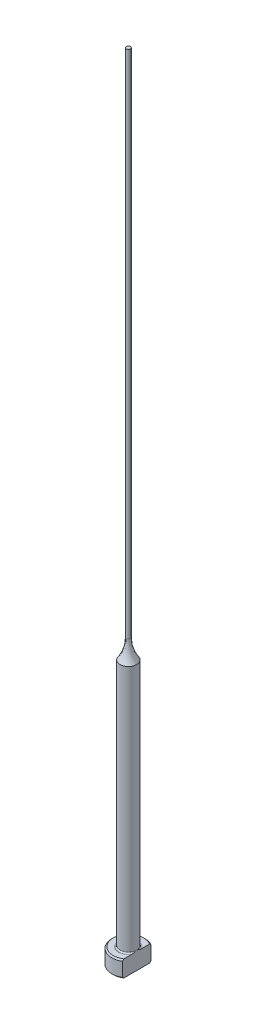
ISO-10303-21;
HEADER;
FILE_DESCRIPTION(('STEP AP214'),'2;1');
FILE_NAME('part.step','',(''),(''),'','','');
FILE_SCHEMA(('AUTOMOTIVE_DESIGN { 1 0 10303 214 1 1 1 1 }'));
ENDSEC;
DATA;
#1=APPLICATION_CONTEXT('core data for automotive mechanical design processes');
#2=APPLICATION_PROTOCOL_DEFINITION('international standard','automotive_design',2000,#1);
#3=PRODUCT_CONTEXT('',#1,'mechanical');
#4=PRODUCT('Part','Part','',(#3));
#5=PRODUCT_RELATED_PRODUCT_CATEGORY('part','',(#4));
#6=PRODUCT_DEFINITION_FORMATION('','',#4);
#7=PRODUCT_DEFINITION_CONTEXT('part definition',#1,'design');
#8=PRODUCT_DEFINITION('design','',#6,#7);
#9=PRODUCT_DEFINITION_SHAPE('','',#8);
#10=(LENGTH_UNIT() NAMED_UNIT(*) SI_UNIT(.MILLI.,.METRE.));
#11=(NAMED_UNIT(*) PLANE_ANGLE_UNIT() SI_UNIT($,.RADIAN.));
#12=(NAMED_UNIT(*) SI_UNIT($,.STERADIAN.) SOLID_ANGLE_UNIT());
#13=UNCERTAINTY_MEASURE_WITH_UNIT(LENGTH_MEASURE(1.E-05),#10,'distance_accuracy_value','');
#14=(GEOMETRIC_REPRESENTATION_CONTEXT(3) GLOBAL_UNCERTAINTY_ASSIGNED_CONTEXT((#13)) GLOBAL_UNIT_ASSIGNED_CONTEXT((#10,
#11,#12)) REPRESENTATION_CONTEXT('',''));
#15=CARTESIAN_POINT('',(0.,0.,0.));
#16=DIRECTION('',(0.,0.,1.));
#17=DIRECTION('',(1.,0.,0.));
#18=AXIS2_PLACEMENT_3D('',#15,#16,#17);
#19=CARTESIAN_POINT('',(-3.17499999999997,3.175,0.));
#20=DIRECTION('',(0.,1.,0.));
#21=DIRECTION('',(0.,0.,1.));
#22=AXIS2_PLACEMENT_3D('',#19,#20,#21);
#23=PLANE('',#22);
#24=CARTESIAN_POINT('',(0.,3.175,0.));
#25=DIRECTION('',(0.,1.,0.));
#26=DIRECTION('',(0.,0.,1.));
#27=AXIS2_PLACEMENT_3D('',#24,#25,#26);
#28=CIRCLE('',#27,2.92099999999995);
#29=CARTESIAN_POINT('',(1.58749999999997,3.175,-2.45195529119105));
#30=VERTEX_POINT('',#29);
#31=CARTESIAN_POINT('',(1.58749999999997,3.175,2.45195529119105));
#32=VERTEX_POINT('',#31);
#33=EDGE_CURVE('E105',#30,#32,#28,.T.);
#34=ORIENTED_EDGE('',*,*,#33,.T.);
#35=DIRECTION('',(0.,0.,1.));
#36=VECTOR('',#35,1.);
#37=CARTESIAN_POINT('',(1.58749999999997,3.17500000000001,2.74963065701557));
#38=LINE('',#37,#36);
#39=CARTESIAN_POINT('',(1.58749999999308,3.175,0.933255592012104));
#40=VERTEX_POINT('',#39);
#41=EDGE_CURVE('E126',#40,#32,#38,.T.);
#42=ORIENTED_EDGE('',*,*,#41,.F.);
#43=CARTESIAN_POINT('',(0.,3.175,0.));
#44=DIRECTION('',(0.,1.,0.));
#45=DIRECTION('',(0.,0.,1.));
#46=AXIS2_PLACEMENT_3D('',#43,#44,#45);
#47=CIRCLE('',#46,1.84149999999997);
#48=CARTESIAN_POINT('',(1.58749999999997,3.17500000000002,-0.933255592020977));
#49=VERTEX_POINT('',#48);
#50=EDGE_CURVE('E11',#40,#49,#47,.F.);
#51=ORIENTED_EDGE('',*,*,#50,.T.);
#52=EDGE_CURVE('E52',#30,#49,#38,.T.);
#53=ORIENTED_EDGE('',*,*,#52,.F.);
#54=EDGE_LOOP('',(#34,#42,#51,#53));
#55=FACE_BOUND('',#54,.T.);
#56=ADVANCED_FACE('F32',(#55),#23,.T.);
#57=CARTESIAN_POINT('',(0.,259.958771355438,0.));
#58=DIRECTION('',(0.,1.,0.));
#59=DIRECTION('',(0.,0.,1.));
#60=AXIS2_PLACEMENT_3D('',#57,#58,#59);
#61=CYLINDRICAL_SURFACE('',#60,3.17499999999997);
#62=CARTESIAN_POINT('',(0.,2.92100000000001,0.));
#63=DIRECTION('',(0.,1.,0.));
#64=DIRECTION('',(0.,0.,1.));
#65=AXIS2_PLACEMENT_3D('',#62,#63,#64);
#66=CIRCLE('',#65,3.17499999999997);
#67=CARTESIAN_POINT('',(1.58749999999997,2.92100000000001,2.74963065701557));
#68=VERTEX_POINT('',#67);
#69=CARTESIAN_POINT('',(1.58749999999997,2.92100000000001,-2.74963065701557));
#70=VERTEX_POINT('',#69);
#71=EDGE_CURVE('E98',#68,#70,#66,.F.);
#72=ORIENTED_EDGE('',*,*,#71,.T.);
#73=DIRECTION('',(0.,-1.,0.));
#74=VECTOR('',#73,1.);
#75=CARTESIAN_POINT('',(1.58749999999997,152.401,-2.74963065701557));
#76=LINE('',#75,#74);
#77=CARTESIAN_POINT('',(1.58749999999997,0.254000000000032,-2.74963065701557));
#78=VERTEX_POINT('',#77);
#79=EDGE_CURVE('E141',#70,#78,#76,.T.);
#80=ORIENTED_EDGE('',*,*,#79,.T.);
#81=CARTESIAN_POINT('',(0.,0.254000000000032,0.));
#82=DIRECTION('',(0.,-1.,0.));
#83=DIRECTION('',(0.,0.,-1.));
#84=AXIS2_PLACEMENT_3D('',#81,#82,#83);
#85=CIRCLE('',#84,3.17499999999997);
#86=CARTESIAN_POINT('',(1.58749999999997,0.254000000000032,2.74963065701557));
#87=VERTEX_POINT('',#86);
#88=EDGE_CURVE('E95',#78,#87,#85,.F.);
#89=ORIENTED_EDGE('',*,*,#88,.T.);
#90=DIRECTION('',(0.,-1.,0.));
#91=VECTOR('',#90,1.);
#92=CARTESIAN_POINT('',(1.58749999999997,152.401,2.74963065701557));
#93=LINE('',#92,#91);
#94=EDGE_CURVE('E88',#68,#87,#93,.T.);
#95=ORIENTED_EDGE('',*,*,#94,.F.);
#96=EDGE_LOOP('',(#72,#80,#89,#95));
#97=FACE_BOUND('',#96,.T.);
#98=ADVANCED_FACE('F191',(#97),#61,.T.);
#99=CARTESIAN_POINT('',(0.,0.,0.));
#100=DIRECTION('',(0.,-1.,0.));
#101=DIRECTION('',(0.,0.,-1.));
#102=AXIS2_PLACEMENT_3D('',#99,#100,#101);
#103=PLANE('',#102);
#104=CARTESIAN_POINT('',(0.,0.,0.));
#105=DIRECTION('',(0.,-1.,0.));
#106=DIRECTION('',(0.,0.,-1.));
#107=AXIS2_PLACEMENT_3D('',#104,#105,#106);
#108=CIRCLE('',#107,2.92099999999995);
#109=CARTESIAN_POINT('',(1.58749999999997,0.,2.45195529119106));
#110=VERTEX_POINT('',#109);
#111=CARTESIAN_POINT('',(1.58749999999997,0.,-2.45195529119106));
#112=VERTEX_POINT('',#111);
#113=EDGE_CURVE('E93',#110,#112,#108,.T.);
#114=ORIENTED_EDGE('',*,*,#113,.T.);
#115=DIRECTION('',(0.,0.,1.));
#116=VECTOR('',#115,1.);
#117=CARTESIAN_POINT('',(1.58749999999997,0.,2.74963065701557));
#118=LINE('',#117,#116);
#119=EDGE_CURVE('E78',#112,#110,#118,.T.);
#120=ORIENTED_EDGE('',*,*,#119,.T.);
#121=EDGE_LOOP('',(#114,#120));
#122=FACE_BOUND('',#121,.T.);
#123=ADVANCED_FACE('F97',(#122),#103,.T.);
#124=CARTESIAN_POINT('',(0.,3.17499999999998,0.));
#125=DIRECTION('',(0.,-1.,0.));
#126=DIRECTION('',(0.,0.,-1.));
#127=AXIS2_PLACEMENT_3D('',#124,#125,#126);
#128=CONICAL_SURFACE('',#127,2.92099999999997,0.7853981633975);
#129=ORIENTED_EDGE('',*,*,#71,.F.);
#130=CARTESIAN_POINT('',(1.58749999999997,-0.161620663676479,-6.0529050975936));
#131=CARTESIAN_POINT('',(1.58749999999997,-0.0288893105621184,-5.91567682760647));
#132=CARTESIAN_POINT('',(1.58749999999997,0.103699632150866,-5.77831035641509));
#133=CARTESIAN_POINT('',(1.58749999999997,0.36850839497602,-5.5032187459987));
#134=CARTESIAN_POINT('',(1.58749999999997,0.500728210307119,-5.36549360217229));
#135=CARTESIAN_POINT('',(1.58749999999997,0.764778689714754,-5.08953516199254));
#136=CARTESIAN_POINT('',(1.58749999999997,0.896609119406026,-4.95130164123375));
#137=CARTESIAN_POINT('',(1.58749999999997,1.15968706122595,-4.67428233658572));
#138=CARTESIAN_POINT('',(1.58749999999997,1.29093457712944,-4.53549655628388));
#139=CARTESIAN_POINT('',(1.58749999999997,1.55007705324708,-4.25997724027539));
#140=CARTESIAN_POINT('',(1.58749999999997,1.67798684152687,-4.12325766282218));
#141=CARTESIAN_POINT('',(1.58749999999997,1.93284861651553,-3.84892898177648));
#142=CARTESIAN_POINT('',(1.58749999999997,2.05980060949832,-3.71131988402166));
#143=CARTESIAN_POINT('',(1.58749999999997,2.31237508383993,-3.43493978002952));
#144=CARTESIAN_POINT('',(1.58749999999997,2.43799784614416,-3.29616903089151));
#145=CARTESIAN_POINT('',(1.58749999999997,2.68741369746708,-3.01699558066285));
#146=CARTESIAN_POINT('',(1.58749999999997,2.81120686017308,-2.87659294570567));
#147=CARTESIAN_POINT('',(1.58749999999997,3.0087586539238,-2.6481670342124));
#148=CARTESIAN_POINT('',(1.58749999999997,3.08336151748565,-2.56087478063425));
#149=CARTESIAN_POINT('',(1.58749999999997,3.23123871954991,-2.38515423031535));
#150=CARTESIAN_POINT('',(1.58749999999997,3.30451292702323,-2.29672582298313));
#151=CARTESIAN_POINT('',(1.58749999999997,3.45004422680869,-2.1174740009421));
#152=CARTESIAN_POINT('',(1.58749999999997,3.52228237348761,-2.02663514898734));
#153=CARTESIAN_POINT('',(1.58749999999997,3.6642309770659,-1.8430252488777));
#154=CARTESIAN_POINT('',(1.58749999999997,3.73394203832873,-1.75025467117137));
#155=CARTESIAN_POINT('',(1.58749999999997,3.87080633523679,-1.56067475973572));
#156=CARTESIAN_POINT('',(1.58749999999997,3.93790459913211,-1.46382547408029));
#157=CARTESIAN_POINT('',(1.58749999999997,4.06669147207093,-1.26632594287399));
#158=CARTESIAN_POINT('',(1.58749999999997,4.12837264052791,-1.16567073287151));
#159=CARTESIAN_POINT('',(1.58749999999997,4.2140225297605,-1.01165766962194));
#160=CARTESIAN_POINT('',(1.58749999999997,4.24127929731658,-0.960142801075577));
#161=CARTESIAN_POINT('',(1.58749999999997,4.29309798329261,-0.855780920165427));
#162=CARTESIAN_POINT('',(1.58749999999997,4.31765941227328,-0.802933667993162));
#163=CARTESIAN_POINT('',(1.58749999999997,4.38614656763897,-0.64246114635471));
#164=CARTESIAN_POINT('',(1.58749999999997,4.42510149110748,-0.532518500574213));
#165=CARTESIAN_POINT('',(1.58749999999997,4.46726244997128,-0.367680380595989));
#166=CARTESIAN_POINT('',(1.58749999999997,4.47844427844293,-0.314802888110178));
#167=CARTESIAN_POINT('',(1.58749999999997,4.495766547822,-0.2082097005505));
#168=CARTESIAN_POINT('',(1.58749999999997,4.50190743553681,-0.154494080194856));
#169=CARTESIAN_POINT('',(1.58749999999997,4.50871296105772,-0.0468792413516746));
#170=CARTESIAN_POINT('',(1.58749999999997,4.50939451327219,0.0070188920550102));
#171=CARTESIAN_POINT('',(1.58749999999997,4.50527679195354,0.114606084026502));
#172=CARTESIAN_POINT('',(1.58749999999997,4.50047706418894,0.168295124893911));
#173=CARTESIAN_POINT('',(1.58749999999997,4.48579689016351,0.274485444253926));
#174=CARTESIAN_POINT('',(1.58749999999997,4.47596081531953,0.326992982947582));
#175=CARTESIAN_POINT('',(1.58749999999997,4.45181809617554,0.430974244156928));
#176=CARTESIAN_POINT('',(1.58749999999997,4.43750969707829,0.48244755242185));
#177=CARTESIAN_POINT('',(1.58749999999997,4.40502489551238,0.584460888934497));
#178=CARTESIAN_POINT('',(1.58749999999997,4.38682724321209,0.634994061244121));
#179=CARTESIAN_POINT('',(1.58749999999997,4.34729308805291,0.734789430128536));
#180=CARTESIAN_POINT('',(1.58749999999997,4.32595722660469,0.784051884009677));
#181=CARTESIAN_POINT('',(1.58749999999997,4.25791922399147,0.930549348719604));
#182=CARTESIAN_POINT('',(1.58749999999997,4.20736047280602,1.02598802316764));
#183=CARTESIAN_POINT('',(1.58749999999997,4.09955451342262,1.2130431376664));
#184=CARTESIAN_POINT('',(1.58749999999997,4.04229912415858,1.30465471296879));
#185=CARTESIAN_POINT('',(1.58749999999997,3.9230874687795,1.4852621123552));
#186=CARTESIAN_POINT('',(1.58749999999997,3.86111349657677,1.57424615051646));
#187=CARTESIAN_POINT('',(1.58749999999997,3.73408621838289,1.74990003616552));
#188=CARTESIAN_POINT('',(1.58749999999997,3.66903444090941,1.8365709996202));
#189=CARTESIAN_POINT('',(1.58749999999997,3.53583371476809,2.00931764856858));
#190=CARTESIAN_POINT('',(1.58749999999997,3.46765527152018,2.09537048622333));
#191=CARTESIAN_POINT('',(1.58749999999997,3.32960643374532,2.26611736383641));
#192=CARTESIAN_POINT('',(1.58749999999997,3.25973586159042,2.35081125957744));
#193=CARTESIAN_POINT('',(1.58749999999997,3.04858139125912,2.60290121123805));
#194=CARTESIAN_POINT('',(1.58749999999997,2.90542388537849,2.76872537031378));
#195=CARTESIAN_POINT('',(1.58749999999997,2.64069522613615,3.06970913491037));
#196=CARTESIAN_POINT('',(1.58749999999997,2.5195945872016,3.20528660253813));
#197=CARTESIAN_POINT('',(1.58749999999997,2.275904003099,3.47510321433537));
#198=CARTESIAN_POINT('',(1.58749999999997,2.15331401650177,3.60934232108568));
#199=CARTESIAN_POINT('',(1.58749999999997,1.90694239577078,3.87695374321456));
#200=CARTESIAN_POINT('',(1.58749999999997,1.78315974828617,4.01032512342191));
#201=CARTESIAN_POINT('',(1.58749999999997,1.53478104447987,4.2763088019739));
#202=CARTESIAN_POINT('',(1.58749999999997,1.41018498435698,4.40892109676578));
#203=CARTESIAN_POINT('',(1.58749999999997,1.0457468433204,4.79499418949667));
#204=CARTESIAN_POINT('',(1.58749999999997,0.805076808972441,5.04767313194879));
#205=CARTESIAN_POINT('',(1.58749999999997,0.443121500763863,5.42550911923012));
#206=CARTESIAN_POINT('',(1.58749999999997,0.322378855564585,5.55118772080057));
#207=CARTESIAN_POINT('',(1.58749999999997,0.0805914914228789,5.80225207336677));
#208=CARTESIAN_POINT('',(1.58749999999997,-0.0404532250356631,5.92763782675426));
#209=CARTESIAN_POINT('',(1.58749999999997,-0.161620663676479,6.0529050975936));
#210=B_SPLINE_CURVE_WITH_KNOTS('',3,(#130,#131,#132,#133,#134,#135,#136,#137,#138,#139,#140,
#141,#142,#143,#144,#145,#146,#147,#148,#149,#150,#151,#152,#153,#154,#155,#156,#157,#158,#159,
#160,#161,#162,#163,#164,#165,#166,#167,#168,#169,#170,#171,#172,#173,#174,#175,#176,#177,#178,
#179,#180,#181,#182,#183,#184,#185,#186,#187,#188,#189,#190,#191,#192,#193,#194,#195,#196,#197,
#198,#199,#200,#201,#202,#203,#204,#205,#206,#207,#208,#209),.UNSPECIFIED.,.F.,.F.,(4,2,2,2,2,2,
2,2,2,2,2,2,2,2,2,2,2,2,2,2,2,2,2,2,2,2,2,2,2,2,2,2,2,2,2,2,2,2,2,4),(0.,0.572750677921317,
1.14550874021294,1.71856057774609,2.29160869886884,2.85328006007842,3.41494773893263,
3.97649423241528,4.53801804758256,4.88249307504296,5.22700189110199,5.57515326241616,
5.92322081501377,6.27657800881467,6.63041319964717,6.80518126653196,6.97998101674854,
7.32824262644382,7.49018491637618,7.65211285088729,7.813538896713,7.97497832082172,
8.13501929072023,8.29512313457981,8.4561251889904,8.61709438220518,8.94062993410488,
9.26456495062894,9.58978187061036,9.91483894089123,10.2441741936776,10.5735441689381,
11.2306812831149,11.7760337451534,12.3214014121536,12.8672825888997,13.4131663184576,
14.4600164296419,14.9828595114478,15.505698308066),.UNSPECIFIED.);
#211=EDGE_CURVE('E118',#32,#68,#210,.T.);
#212=ORIENTED_EDGE('',*,*,#211,.F.);
#213=ORIENTED_EDGE('',*,*,#33,.F.);
#214=EDGE_CURVE('E117',#70,#30,#210,.T.);
#215=ORIENTED_EDGE('',*,*,#214,.F.);
#216=EDGE_LOOP('',(#129,#212,#213,#215));
#217=FACE_BOUND('',#216,.T.);
#218=ADVANCED_FACE('F162',(#217),#128,.T.);
#219=CARTESIAN_POINT('',(0.,0.254000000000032,0.));
#220=DIRECTION('',(0.,1.,0.));
#221=DIRECTION('',(0.,0.,1.));
#222=AXIS2_PLACEMENT_3D('',#219,#220,#221);
#223=CONICAL_SURFACE('',#222,3.17499999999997,0.785398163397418);
#224=ORIENTED_EDGE('',*,*,#88,.F.);
#225=CARTESIAN_POINT('',(1.58749999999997,3.33662066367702,6.0529050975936));
#226=CARTESIAN_POINT('',(1.58749999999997,3.20388931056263,5.91567682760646));
#227=CARTESIAN_POINT('',(1.58749999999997,3.0713003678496,5.77831035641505));
#228=CARTESIAN_POINT('',(1.58749999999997,2.80649160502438,5.50321874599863));
#229=CARTESIAN_POINT('',(1.58749999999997,2.67427178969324,5.36549360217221));
#230=CARTESIAN_POINT('',(1.58749999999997,2.41022131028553,5.08953516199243));
#231=CARTESIAN_POINT('',(1.58749999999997,2.27839088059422,4.95130164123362));
#232=CARTESIAN_POINT('',(1.58749999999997,2.01531293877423,4.67428233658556));
#233=CARTESIAN_POINT('',(1.58749999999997,1.8840654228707,4.5354965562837));
#234=CARTESIAN_POINT('',(1.58749999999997,1.62492294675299,4.25997724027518));
#235=CARTESIAN_POINT('',(1.58749999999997,1.49701315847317,4.12325766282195));
#236=CARTESIAN_POINT('',(1.58749999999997,1.24215138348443,3.84892898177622));
#237=CARTESIAN_POINT('',(1.58749999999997,1.11519939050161,3.71131988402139));
#238=CARTESIAN_POINT('',(1.58749999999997,0.862624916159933,3.43493978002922));
#239=CARTESIAN_POINT('',(1.58749999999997,0.737002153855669,3.29616903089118));
#240=CARTESIAN_POINT('',(1.58749999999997,0.487586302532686,3.01699558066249));
#241=CARTESIAN_POINT('',(1.58749999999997,0.363793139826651,2.8765929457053));
#242=CARTESIAN_POINT('',(1.58749999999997,0.1662413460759,2.64816703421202));
#243=CARTESIAN_POINT('',(1.58749999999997,0.0916384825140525,2.56087478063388));
#244=CARTESIAN_POINT('',(1.58749999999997,-0.0562387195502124,2.385154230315));
#245=CARTESIAN_POINT('',(1.58749999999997,-0.129512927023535,2.29672582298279));
#246=CARTESIAN_POINT('',(1.58749999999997,-0.275044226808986,2.11747400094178));
#247=CARTESIAN_POINT('',(1.58749999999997,-0.34728237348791,2.02663514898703));
#248=CARTESIAN_POINT('',(1.58749999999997,-0.489230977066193,1.84302524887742));
#249=CARTESIAN_POINT('',(1.58749999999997,-0.558942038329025,1.75025467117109));
#250=CARTESIAN_POINT('',(1.58749999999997,-0.695806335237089,1.56067475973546));
#251=CARTESIAN_POINT('',(1.58749999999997,-0.762904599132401,1.46382547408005));
#252=CARTESIAN_POINT('',(1.58749999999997,-0.89169147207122,1.26632594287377));
#253=CARTESIAN_POINT('',(1.58749999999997,-0.953372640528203,1.16567073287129));
#254=CARTESIAN_POINT('',(1.58749999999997,-1.03902252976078,1.01165766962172));
#255=CARTESIAN_POINT('',(1.58749999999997,-1.06627929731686,0.960142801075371));
#256=CARTESIAN_POINT('',(1.58749999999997,-1.11809798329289,0.855780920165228));
#257=CARTESIAN_POINT('',(1.58749999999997,-1.14265941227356,0.802933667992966));
#258=CARTESIAN_POINT('',(1.58749999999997,-1.21114656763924,0.642461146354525));
#259=CARTESIAN_POINT('',(1.58749999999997,-1.25010149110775,0.532518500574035));
#260=CARTESIAN_POINT('',(1.58749999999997,-1.29226244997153,0.36768038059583));
#261=CARTESIAN_POINT('',(1.58749999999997,-1.30344427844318,0.31480288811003));
#262=CARTESIAN_POINT('',(1.58749999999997,-1.32076654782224,0.208209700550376));
#263=CARTESIAN_POINT('',(1.58749999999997,-1.32690743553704,0.154494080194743));
#264=CARTESIAN_POINT('',(1.58749999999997,-1.33371296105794,0.0468792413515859));
#265=CARTESIAN_POINT('',(1.58749999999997,-1.33439451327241,-0.0070188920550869));
#266=CARTESIAN_POINT('',(1.58749999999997,-1.33027679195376,-0.114606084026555));
#267=CARTESIAN_POINT('',(1.58749999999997,-1.32547706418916,-0.168295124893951));
#268=CARTESIAN_POINT('',(1.58749999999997,-1.31079689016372,-0.274485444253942));
#269=CARTESIAN_POINT('',(1.58749999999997,-1.30096081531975,-0.326992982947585));
#270=CARTESIAN_POINT('',(1.58749999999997,-1.27681809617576,-0.430974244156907));
#271=CARTESIAN_POINT('',(1.58749999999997,-1.26250969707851,-0.482447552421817));
#272=CARTESIAN_POINT('',(1.58749999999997,-1.2300248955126,-0.584460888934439));
#273=CARTESIAN_POINT('',(1.58749999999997,-1.21182724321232,-0.634994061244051));
#274=CARTESIAN_POINT('',(1.58749999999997,-1.17229308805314,-0.734789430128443));
#275=CARTESIAN_POINT('',(1.58749999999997,-1.15095722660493,-0.784051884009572));
#276=CARTESIAN_POINT('',(1.58749999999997,-1.08291922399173,-0.93054934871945));
#277=CARTESIAN_POINT('',(1.58749999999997,-1.0323604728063,-1.02598802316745));
#278=CARTESIAN_POINT('',(1.58749999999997,-0.92455451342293,-1.21304313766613));
#279=CARTESIAN_POINT('',(1.58749999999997,-0.867299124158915,-1.30465471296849));
#280=CARTESIAN_POINT('',(1.58749999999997,-0.748087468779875,-1.48526211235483));
#281=CARTESIAN_POINT('',(1.58749999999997,-0.686113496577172,-1.57424615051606));
#282=CARTESIAN_POINT('',(1.58749999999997,-0.559086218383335,-1.74990003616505));
#283=CARTESIAN_POINT('',(1.58749999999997,-0.494034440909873,-1.83657099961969));
#284=CARTESIAN_POINT('',(1.58749999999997,-0.360833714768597,-2.00931764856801));
#285=CARTESIAN_POINT('',(1.58749999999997,-0.292655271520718,-2.09537048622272));
#286=CARTESIAN_POINT('',(1.58749999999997,-0.154606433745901,-2.26611736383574));
#287=CARTESIAN_POINT('',(1.58749999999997,-0.084735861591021,-2.35081125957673));
#288=CARTESIAN_POINT('',(1.58749999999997,0.126418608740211,-2.60290121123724));
#289=CARTESIAN_POINT('',(1.58749999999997,0.26957611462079,-2.76872537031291));
#290=CARTESIAN_POINT('',(1.58749999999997,0.534304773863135,-3.06970913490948));
#291=CARTESIAN_POINT('',(1.58749999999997,0.655405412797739,-3.20528660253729));
#292=CARTESIAN_POINT('',(1.58749999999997,0.899095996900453,-3.47510321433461));
#293=CARTESIAN_POINT('',(1.58749999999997,1.02168598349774,-3.60934232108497));
#294=CARTESIAN_POINT('',(1.58749999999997,1.26805760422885,-3.87695374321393));
#295=CARTESIAN_POINT('',(1.58749999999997,1.39184025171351,-4.01032512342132));
#296=CARTESIAN_POINT('',(1.58749999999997,1.64021895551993,-4.2763088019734));
#297=CARTESIAN_POINT('',(1.58749999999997,1.76481501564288,-4.40892109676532));
#298=CARTESIAN_POINT('',(1.58749999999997,2.12925315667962,-4.79499418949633));
#299=CARTESIAN_POINT('',(1.58749999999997,2.36992319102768,-5.04767313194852));
#300=CARTESIAN_POINT('',(1.58749999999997,2.73187849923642,-5.42550911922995));
#301=CARTESIAN_POINT('',(1.58749999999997,2.85262114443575,-5.55118772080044));
#302=CARTESIAN_POINT('',(1.58749999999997,3.09440850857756,-5.8022520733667));
#303=CARTESIAN_POINT('',(1.58749999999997,3.21545322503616,-5.92763782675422));
#304=CARTESIAN_POINT('',(1.58749999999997,3.33662066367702,-6.0529050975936));
#305=B_SPLINE_CURVE_WITH_KNOTS('',3,(#225,#226,#227,#228,#229,#230,#231,#232,#233,#234,#235,
#236,#237,#238,#239,#240,#241,#242,#243,#244,#245,#246,#247,#248,#249,#250,#251,#252,#253,#254,
#255,#256,#257,#258,#259,#260,#261,#262,#263,#264,#265,#266,#267,#268,#269,#270,#271,#272,#273,
#274,#275,#276,#277,#278,#279,#280,#281,#282,#283,#284,#285,#286,#287,#288,#289,#290,#291,#292,
#293,#294,#295,#296,#297,#298,#299,#300,#301,#302,#303,#304),.UNSPECIFIED.,.F.,.F.,(4,2,2,2,2,2,
2,2,2,2,2,2,2,2,2,2,2,2,2,2,2,2,2,2,2,2,2,2,2,2,2,2,2,2,2,2,2,2,2,4),(0.,0.572750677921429,
1.14550874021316,1.71856057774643,2.29160869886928,2.85328006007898,3.41494773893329,
3.97649423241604,4.53801804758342,4.8824930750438,5.22700189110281,5.57515326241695,
5.92322081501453,6.27657800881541,6.63041319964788,6.80518126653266,6.97998101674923,
7.32824262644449,7.49018491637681,7.65211285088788,7.81353889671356,7.97497832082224,
8.13501929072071,8.29512313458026,8.45612518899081,8.61709438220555,8.94062993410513,
9.26456495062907,9.58978187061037,9.91483894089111,10.2441741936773,10.5735441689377,
11.2306812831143,11.776033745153,12.3214014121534,12.8672825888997,13.4131663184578,
14.4600164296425,14.9828595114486,15.505698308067),.UNSPECIFIED.);
#306=EDGE_CURVE('E81',#112,#78,#305,.T.);
#307=ORIENTED_EDGE('',*,*,#306,.F.);
#308=ORIENTED_EDGE('',*,*,#113,.F.);
#309=EDGE_CURVE('E84',#87,#110,#305,.T.);
#310=ORIENTED_EDGE('',*,*,#309,.F.);
#311=EDGE_LOOP('',(#224,#307,#308,#310));
#312=FACE_BOUND('',#311,.T.);
#313=ADVANCED_FACE('F92',(#312),#223,.T.);
#314=CARTESIAN_POINT('',(0.,3.42900000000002,0.));
#315=DIRECTION('',(0.,1.,0.));
#316=DIRECTION('',(0.,0.,1.));
#317=AXIS2_PLACEMENT_3D('',#314,#315,#316);
#318=TOROIDAL_SURFACE('',#317,1.84149999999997,0.254);
#319=CARTESIAN_POINT('',(1.58749999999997,3.42900000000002,0.));
#320=CARTESIAN_POINT('',(1.58749999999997,3.42899942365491,-1.9220514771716E-10));
#321=CARTESIAN_POINT('',(1.58749999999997,3.42899884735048,-1.2261161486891E-07));
#322=CARTESIAN_POINT('',(1.58749999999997,3.42899773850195,-5.09676365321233E-07));
#323=CARTESIAN_POINT('',(1.58749999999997,3.42899720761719,-7.78176328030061E-07));
#324=CARTESIAN_POINT('',(1.58749999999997,3.42899614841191,-1.42307272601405E-06));
#325=CARTESIAN_POINT('',(1.58749999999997,3.42899562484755,-1.80713867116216E-06));
#326=CARTESIAN_POINT('',(1.58749999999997,3.42899463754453,-2.63494846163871E-06));
#327=CARTESIAN_POINT('',(1.58749999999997,3.42899417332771,-3.07814756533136E-06));
#328=CARTESIAN_POINT('',(1.58749999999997,3.42899261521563,-4.66897357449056E-06));
#329=CARTESIAN_POINT('',(1.58749999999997,3.42899159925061,-5.89404908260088E-06));
#330=CARTESIAN_POINT('',(1.58749999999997,3.42898979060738,-8.42427511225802E-06));
#331=CARTESIAN_POINT('',(1.58749999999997,3.42898899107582,-9.7248057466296E-06));
#332=CARTESIAN_POINT('',(1.58749999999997,3.42898598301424,-1.48060601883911E-05));
#333=CARTESIAN_POINT('',(1.58749999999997,3.42898393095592,-1.86838281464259E-05));
#334=CARTESIAN_POINT('',(1.58749999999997,3.42898057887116,-2.63261117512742E-05));
#335=CARTESIAN_POINT('',(1.58749999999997,3.42897922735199,-3.00687417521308E-05));
#336=CARTESIAN_POINT('',(1.58749999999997,3.42897347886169,-4.60276298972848E-05));
#337=CARTESIAN_POINT('',(1.58749999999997,3.42896911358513,-5.8247019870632E-05));
#338=CARTESIAN_POINT('',(1.58749999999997,3.42896211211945,-8.11070097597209E-05));
#339=CARTESIAN_POINT('',(1.58749999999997,3.42895931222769,-9.16953114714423E-05));
#340=CARTESIAN_POINT('',(1.58749999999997,3.42893712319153,-0.000168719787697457));
#341=CARTESIAN_POINT('',(1.58749999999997,3.42890881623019,-0.000232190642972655));
#342=CARTESIAN_POINT('',(1.58749999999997,3.42880276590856,-0.000479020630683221));
#343=CARTESIAN_POINT('',(1.58749999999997,3.42873165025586,-0.00066443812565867));
#344=CARTESIAN_POINT('',(1.58749999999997,3.42845137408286,-0.0013844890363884));
#345=CARTESIAN_POINT('',(1.58749999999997,3.42823526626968,-0.00191701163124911));
#346=CARTESIAN_POINT('',(1.58749999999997,3.42735449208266,-0.00409774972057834));
#347=CARTESIAN_POINT('',(1.58749999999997,3.42669768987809,-0.00574830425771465));
#348=CARTESIAN_POINT('',(1.58749999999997,3.4174405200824,-0.0289985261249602));
#349=CARTESIAN_POINT('',(1.58749999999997,3.40878325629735,-0.0505816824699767));
#350=CARTESIAN_POINT('',(1.58749999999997,3.39189297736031,-0.0929947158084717));
#351=CARTESIAN_POINT('',(1.58749999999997,3.38365605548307,-0.11382315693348));
#352=CARTESIAN_POINT('',(1.58749999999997,3.36635393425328,-0.157956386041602));
#353=CARTESIAN_POINT('',(1.58749999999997,3.35730391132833,-0.181267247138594));
#354=CARTESIAN_POINT('',(1.58749999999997,3.33936775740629,-0.228222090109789));
#355=CARTESIAN_POINT('',(1.58749999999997,3.33048420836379,-0.25186705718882));
#356=CARTESIAN_POINT('',(1.58749999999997,3.30894496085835,-0.310512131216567));
#357=CARTESIAN_POINT('',(1.58749999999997,3.29649449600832,-0.345588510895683));
#358=CARTESIAN_POINT('',(1.58749999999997,3.27296975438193,-0.415278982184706));
#359=CARTESIAN_POINT('',(1.58749999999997,3.26186987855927,-0.449884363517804));
#360=CARTESIAN_POINT('',(1.58749999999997,3.2395832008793,-0.524471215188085));
#361=CARTESIAN_POINT('',(1.58749999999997,3.22860862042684,-0.564517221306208));
#362=CARTESIAN_POINT('',(1.58749999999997,3.20902534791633,-0.645529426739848));
#363=CARTESIAN_POINT('',(1.58749999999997,3.20043582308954,-0.686500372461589));
#364=CARTESIAN_POINT('',(1.58749999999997,3.18611712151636,-0.771546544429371));
#365=CARTESIAN_POINT('',(1.58749999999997,3.18059550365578,-0.815658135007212));
#366=CARTESIAN_POINT('',(1.58749999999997,3.17455396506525,-0.904117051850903));
#367=CARTESIAN_POINT('',(1.58749999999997,3.17401361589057,-0.948462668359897));
#368=CARTESIAN_POINT('',(1.58749999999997,3.17898948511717,-1.02531896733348));
#369=CARTESIAN_POINT('',(1.58749999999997,3.1829739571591,-1.05792141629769));
#370=CARTESIAN_POINT('',(1.58749999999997,3.19569167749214,-1.12184393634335));
#371=CARTESIAN_POINT('',(1.58749999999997,3.20436049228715,-1.1531753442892));
#372=CARTESIAN_POINT('',(1.58749999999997,3.22236152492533,-1.19946468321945));
#373=CARTESIAN_POINT('',(1.58749999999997,3.2295150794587,-1.21526783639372));
#374=CARTESIAN_POINT('',(1.58749999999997,3.24587062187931,-1.24583726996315));
#375=CARTESIAN_POINT('',(1.58749999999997,3.25507530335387,-1.26060215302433));
#376=CARTESIAN_POINT('',(1.58749999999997,3.27378481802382,-1.28575815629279));
#377=CARTESIAN_POINT('',(1.58749999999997,3.28289001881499,-1.29644383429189));
#378=CARTESIAN_POINT('',(1.58749999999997,3.30268460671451,-1.31623154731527));
#379=CARTESIAN_POINT('',(1.58749999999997,3.31337067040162,-1.32533681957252));
#380=CARTESIAN_POINT('',(1.58749999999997,3.33349977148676,-1.33941140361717));
#381=CARTESIAN_POINT('',(1.58749999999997,3.34261446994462,-1.34484814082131));
#382=CARTESIAN_POINT('',(1.58749999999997,3.36161455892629,-1.35416329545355));
#383=CARTESIAN_POINT('',(1.58749999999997,3.37149946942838,-1.35804267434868));
#384=CARTESIAN_POINT('',(1.58749999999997,3.39188678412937,-1.36398436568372));
#385=CARTESIAN_POINT('',(1.58749999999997,3.40239309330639,-1.36603350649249));
#386=CARTESIAN_POINT('',(1.58749999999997,3.42360372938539,-1.3680840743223));
#387=CARTESIAN_POINT('',(1.58749999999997,3.43430795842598,-1.36808648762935));
#388=CARTESIAN_POINT('',(1.58749999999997,3.45433283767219,-1.36616208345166));
#389=CARTESIAN_POINT('',(1.58749999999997,3.46367506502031,-1.36444960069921));
#390=CARTESIAN_POINT('',(1.58749999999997,3.48195519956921,-1.35953338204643));
#391=CARTESIAN_POINT('',(1.58749999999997,3.49089304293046,-1.3563294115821));
#392=CARTESIAN_POINT('',(1.58749999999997,3.50850302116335,-1.34848006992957));
#393=CARTESIAN_POINT('',(1.58749999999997,3.5171531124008,-1.34378578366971));
#394=CARTESIAN_POINT('',(1.58749999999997,3.53371257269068,-1.33324445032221));
#395=CARTESIAN_POINT('',(1.58749999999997,3.54162163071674,-1.32739692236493));
#396=CARTESIAN_POINT('',(1.58749999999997,3.56107121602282,-1.31107304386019));
#397=CARTESIAN_POINT('',(1.58749999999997,3.57202221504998,-1.29989286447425));
#398=CARTESIAN_POINT('',(1.58749999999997,3.59202509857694,-1.27593566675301));
#399=CARTESIAN_POINT('',(1.58749999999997,3.60107086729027,-1.26315370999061));
#400=CARTESIAN_POINT('',(1.58749999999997,3.62186023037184,-1.22930733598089));
#401=CARTESIAN_POINT('',(1.58749999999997,3.63240584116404,-1.20751096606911));
#402=CARTESIAN_POINT('',(1.58749999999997,3.65004643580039,-1.16266144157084));
#403=CARTESIAN_POINT('',(1.58749999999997,3.65714435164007,-1.13960937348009));
#404=CARTESIAN_POINT('',(1.58749999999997,3.67265428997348,-1.07603916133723));
#405=CARTESIAN_POINT('',(1.58749999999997,3.67834921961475,-1.03486686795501));
#406=CARTESIAN_POINT('',(1.58749999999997,3.68382880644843,-0.951558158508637));
#407=CARTESIAN_POINT('',(1.58749999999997,3.68350976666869,-0.909417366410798));
#408=CARTESIAN_POINT('',(1.58749999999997,3.67745397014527,-0.811383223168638));
#409=CARTESIAN_POINT('',(1.58749999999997,3.66993873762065,-0.755610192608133));
#410=CARTESIAN_POINT('',(1.58749999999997,3.64933373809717,-0.644937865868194));
#411=CARTESIAN_POINT('',(1.58749999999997,3.63621897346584,-0.59004364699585));
#412=CARTESIAN_POINT('',(1.58749999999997,3.60740922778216,-0.485757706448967));
#413=CARTESIAN_POINT('',(1.58749999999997,3.59201096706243,-0.436281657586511));
#414=CARTESIAN_POINT('',(1.58749999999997,3.55922497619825,-0.338551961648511));
#415=CARTESIAN_POINT('',(1.58749999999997,3.5418584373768,-0.290291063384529));
#416=CARTESIAN_POINT('',(1.58749999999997,3.51760237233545,-0.225557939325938));
#417=CARTESIAN_POINT('',(1.58749999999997,3.51126413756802,-0.208874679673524));
#418=CARTESIAN_POINT('',(1.58749999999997,3.49830042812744,-0.17512392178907));
#419=CARTESIAN_POINT('',(1.58749999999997,3.49167176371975,-0.158057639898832));
#420=CARTESIAN_POINT('',(1.58749999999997,3.47585523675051,-0.117638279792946));
#421=CARTESIAN_POINT('',(1.58749999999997,3.46662970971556,-0.0943002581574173));
#422=CARTESIAN_POINT('',(1.58749999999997,3.44889695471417,-0.0497824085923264));
#423=CARTESIAN_POINT('',(1.58749999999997,3.44040039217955,-0.028598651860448));
#424=CARTESIAN_POINT('',(1.58749999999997,3.43130364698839,-0.00575168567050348));
#425=CARTESIAN_POINT('',(1.58749999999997,3.43064818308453,-0.00410451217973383));
#426=CARTESIAN_POINT('',(1.58749999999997,3.42976776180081,-0.00192459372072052));
#427=CARTESIAN_POINT('',(1.58749999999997,3.42955062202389,-0.00138952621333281));
#428=CARTESIAN_POINT('',(1.58749999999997,3.42926908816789,-0.000666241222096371));
#429=CARTESIAN_POINT('',(1.58749999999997,3.42919771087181,-0.000480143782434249));
#430=CARTESIAN_POINT('',(1.58749999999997,3.42909131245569,-0.000232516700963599));
#431=CARTESIAN_POINT('',(1.58749999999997,3.42906294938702,-0.000168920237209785));
#432=CARTESIAN_POINT('',(1.58749999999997,3.42904072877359,-9.17527162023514E-05));
#433=CARTESIAN_POINT('',(1.58749999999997,3.42903792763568,-8.11550293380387E-05));
#434=CARTESIAN_POINT('',(1.58749999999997,3.42903091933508,-5.82743948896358E-05));
#435=CARTESIAN_POINT('',(1.58749999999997,3.42902654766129,-4.60440001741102E-05));
#436=CARTESIAN_POINT('',(1.58749999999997,3.42902079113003,-3.00727682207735E-05));
#437=CARTESIAN_POINT('',(1.58749999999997,3.42901943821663,-2.63286807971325E-05));
#438=CARTESIAN_POINT('',(1.58749999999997,3.42901608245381,-1.86836529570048E-05));
#439=CARTESIAN_POINT('',(1.58749999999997,3.4290140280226,-1.48046517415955E-05));
#440=CARTESIAN_POINT('',(1.58749999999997,3.42901101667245,-9.72223943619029E-06));
#441=CARTESIAN_POINT('',(1.58749999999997,3.42901021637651,-8.42159649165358E-06));
#442=CARTESIAN_POINT('',(1.58749999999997,3.42900840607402,-5.89129729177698E-06));
#443=CARTESIAN_POINT('',(1.58749999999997,3.42900738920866,-4.66626867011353E-06));
#444=CARTESIAN_POINT('',(1.58749999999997,3.42900582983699,-3.07568803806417E-06));
#445=CARTESIAN_POINT('',(1.58749999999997,3.42900536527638,-2.63259565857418E-06));
#446=CARTESIAN_POINT('',(1.58749999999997,3.4290043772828,-1.80506085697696E-06));
#447=CARTESIAN_POINT('',(1.58749999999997,3.42900385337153,-1.42116387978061E-06));
#448=CARTESIAN_POINT('',(1.58749999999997,3.42900279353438,-7.76675643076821E-07));
#449=CARTESIAN_POINT('',(1.58749999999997,3.42900226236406,-5.08406487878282E-07));
#450=CARTESIAN_POINT('',(1.58749999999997,3.42900115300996,-1.21901887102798E-07));
#451=CARTESIAN_POINT('',(1.58749999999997,3.42900057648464,1.92251677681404E-10));
#452=CARTESIAN_POINT('',(1.58749999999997,3.42900000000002,0.));
#453=B_SPLINE_CURVE_WITH_KNOTS('',3,(#319,#320,#321,#322,#323,#324,#325,#326,#327,#328,#329,
#330,#331,#332,#333,#334,#335,#336,#337,#338,#339,#340,#341,#342,#343,#344,#345,#346,#347,#348,
#349,#350,#351,#352,#353,#354,#355,#356,#357,#358,#359,#360,#361,#362,#363,#364,#365,#366,#367,
#368,#369,#370,#371,#372,#373,#374,#375,#376,#377,#378,#379,#380,#381,#382,#383,#384,#385,#386,
#387,#388,#389,#390,#391,#392,#393,#394,#395,#396,#397,#398,#399,#400,#401,#402,#403,#404,#405,
#406,#407,#408,#409,#410,#411,#412,#413,#414,#415,#416,#417,#418,#419,#420,#421,#422,#423,#424,
#425,#426,#427,#428,#429,#430,#431,#432,#433,#434,#435,#436,#437,#438,#439,#440,#441,#442,#443,
#444,#445,#446,#447,#448,#449,#450,#451,#452),.UNSPECIFIED.,.T.,.F.,(4,2,2,2,2,2,2,2,2,2,2,2,2,
2,2,2,2,2,2,2,2,2,2,2,2,2,2,2,2,2,2,2,2,2,2,2,2,2,2,2,2,2,2,2,2,2,2,2,2,2,2,2,2,2,2,2,2,2,2,2,2,
2,2,2,2,2,4),(0.,1.72815458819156E-06,3.50429255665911E-06,5.44431004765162E-06,
7.3675525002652E-06,1.2119089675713E-05,1.66953775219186E-05,2.98160400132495E-05,
4.17409564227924E-05,8.0660475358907E-05,0.000113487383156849,0.000321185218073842,
0.000917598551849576,0.00264089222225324,0.00797105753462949,0.0777276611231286,
0.144923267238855,0.219939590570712,0.295714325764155,0.407362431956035,0.516367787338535,
0.640878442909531,0.766362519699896,0.899536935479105,1.03216495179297,1.13045740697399,
1.22743103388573,1.27935899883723,1.33135556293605,1.37333248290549,1.41522237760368,
1.44693946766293,1.47863694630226,1.51056074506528,1.54246916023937,1.57083210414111,
1.59919951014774,1.62861579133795,1.65804436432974,1.70472658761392,1.75155645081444,
1.82378709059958,1.89595619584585,2.01995471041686,2.1460932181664,2.31447224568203,
2.48361094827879,2.6389891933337,2.79283011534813,2.84637031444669,2.9012946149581,
2.97658236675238,3.04504771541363,3.05036697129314,3.05209849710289,3.05269709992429,
3.05290520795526,3.05293806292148,3.05297701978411,3.05298895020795,3.05300207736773,
3.05300665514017,3.0530114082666,3.05301333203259,3.05301527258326,3.05301704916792,
3.05301877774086),.UNSPECIFIED.);
#454=CARTESIAN_POINT('',(1.58749999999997,3.42900000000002,0.));
#455=VERTEX_POINT('',#454);
#456=EDGE_CURVE('E47',#455,#49,#453,.T.);
#457=ORIENTED_EDGE('',*,*,#456,.T.);
#458=ORIENTED_EDGE('',*,*,#50,.F.);
#459=CARTESIAN_POINT('',(1.58749999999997,3.42900000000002,0.));
#460=CARTESIAN_POINT('',(1.58749999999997,3.42900057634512,1.9220512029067E-10));
#461=CARTESIAN_POINT('',(1.58749999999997,3.42900115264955,1.22611614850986E-07));
#462=CARTESIAN_POINT('',(1.58749999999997,3.42900226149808,5.09676365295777E-07));
#463=CARTESIAN_POINT('',(1.58749999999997,3.42900279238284,7.78176328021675E-07));
#464=CARTESIAN_POINT('',(1.58749999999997,3.42900385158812,1.42307272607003E-06));
#465=CARTESIAN_POINT('',(1.58749999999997,3.42900437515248,1.80713867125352E-06));
#466=CARTESIAN_POINT('',(1.58749999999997,3.4290053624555,2.63494846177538E-06));
#467=CARTESIAN_POINT('',(1.58749999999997,3.42900582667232,3.0781475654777E-06));
#468=CARTESIAN_POINT('',(1.58749999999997,3.4290073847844,4.66897357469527E-06));
#469=CARTESIAN_POINT('',(1.58749999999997,3.42900840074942,5.89404908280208E-06));
#470=CARTESIAN_POINT('',(1.58749999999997,3.42901020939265,8.42427511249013E-06));
#471=CARTESIAN_POINT('',(1.58749999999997,3.42901100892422,9.72480574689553E-06));
#472=CARTESIAN_POINT('',(1.58749999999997,3.42901401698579,1.48060601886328E-05));
#473=CARTESIAN_POINT('',(1.58749999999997,3.42901606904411,1.86838281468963E-05));
#474=CARTESIAN_POINT('',(1.58749999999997,3.42901942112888,2.63261117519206E-05));
#475=CARTESIAN_POINT('',(1.58749999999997,3.42902077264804,3.00687417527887E-05));
#476=CARTESIAN_POINT('',(1.58749999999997,3.42902652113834,4.60276298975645E-05));
#477=CARTESIAN_POINT('',(1.58749999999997,3.4290308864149,5.82470198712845E-05));
#478=CARTESIAN_POINT('',(1.58749999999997,3.42903788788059,8.11070097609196E-05));
#479=CARTESIAN_POINT('',(1.58749999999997,3.42904068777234,9.16953114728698E-05));
#480=CARTESIAN_POINT('',(1.58749999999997,3.4290628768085,0.000168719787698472));
#481=CARTESIAN_POINT('',(1.58749999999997,3.42909118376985,0.000232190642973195));
#482=CARTESIAN_POINT('',(1.58749999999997,3.42919723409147,0.000479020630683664));
#483=CARTESIAN_POINT('',(1.58749999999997,3.42926834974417,0.000664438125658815));
#484=CARTESIAN_POINT('',(1.58749999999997,3.42954862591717,0.00138448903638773));
#485=CARTESIAN_POINT('',(1.58749999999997,3.42976473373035,0.00191701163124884));
#486=CARTESIAN_POINT('',(1.58749999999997,3.43064550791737,0.00409774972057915));
#487=CARTESIAN_POINT('',(1.58749999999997,3.43130231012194,0.00574830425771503));
#488=CARTESIAN_POINT('',(1.58749999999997,3.44055947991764,0.0289985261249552));
#489=CARTESIAN_POINT('',(1.58749999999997,3.44921674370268,0.0505816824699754));
#490=CARTESIAN_POINT('',(1.58749999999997,3.46610702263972,0.0929947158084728));
#491=CARTESIAN_POINT('',(1.58749999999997,3.47434394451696,0.11382315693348));
#492=CARTESIAN_POINT('',(1.58749999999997,3.49164606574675,0.157956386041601));
#493=CARTESIAN_POINT('',(1.58749999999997,3.5006960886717,0.181267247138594));
#494=CARTESIAN_POINT('',(1.58749999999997,3.51863224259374,0.228222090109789));
#495=CARTESIAN_POINT('',(1.58749999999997,3.52751579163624,0.25186705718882));
#496=CARTESIAN_POINT('',(1.58749999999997,3.54905503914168,0.310512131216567));
#497=CARTESIAN_POINT('',(1.58749999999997,3.56150550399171,0.345588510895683));
#498=CARTESIAN_POINT('',(1.58749999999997,3.5850302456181,0.415278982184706));
#499=CARTESIAN_POINT('',(1.58749999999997,3.59613012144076,0.449884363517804));
#500=CARTESIAN_POINT('',(1.58749999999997,3.61841679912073,0.524471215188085));
#501=CARTESIAN_POINT('',(1.58749999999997,3.62939137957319,0.564517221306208));
#502=CARTESIAN_POINT('',(1.58749999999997,3.6489746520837,0.645529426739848));
#503=CARTESIAN_POINT('',(1.58749999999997,3.65756417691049,0.686500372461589));
#504=CARTESIAN_POINT('',(1.58749999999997,3.67188287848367,0.771546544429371));
#505=CARTESIAN_POINT('',(1.58749999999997,3.67740449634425,0.815658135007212));
#506=CARTESIAN_POINT('',(1.58749999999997,3.68344603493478,0.904117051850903));
#507=CARTESIAN_POINT('',(1.58749999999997,3.68398638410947,0.948462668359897));
#508=CARTESIAN_POINT('',(1.58749999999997,3.67901051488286,1.02531896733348));
#509=CARTESIAN_POINT('',(1.58749999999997,3.67502604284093,1.05792141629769));
#510=CARTESIAN_POINT('',(1.58749999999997,3.66230832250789,1.12184393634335));
#511=CARTESIAN_POINT('',(1.58749999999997,3.65363950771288,1.1531753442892));
#512=CARTESIAN_POINT('',(1.58749999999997,3.6356384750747,1.19946468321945));
#513=CARTESIAN_POINT('',(1.58749999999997,3.62848492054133,1.21526783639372));
#514=CARTESIAN_POINT('',(1.58749999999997,3.61212937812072,1.24583726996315));
#515=CARTESIAN_POINT('',(1.58749999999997,3.60292469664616,1.26060215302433));
#516=CARTESIAN_POINT('',(1.58749999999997,3.58421518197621,1.28575815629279));
#517=CARTESIAN_POINT('',(1.58749999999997,3.57510998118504,1.29644383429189));
#518=CARTESIAN_POINT('',(1.58749999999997,3.55531539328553,1.31623154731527));
#519=CARTESIAN_POINT('',(1.58749999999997,3.54462932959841,1.32533681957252));
#520=CARTESIAN_POINT('',(1.58749999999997,3.52450022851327,1.33941140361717));
#521=CARTESIAN_POINT('',(1.58749999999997,3.51538553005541,1.34484814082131));
#522=CARTESIAN_POINT('',(1.58749999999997,3.49638544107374,1.35416329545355));
#523=CARTESIAN_POINT('',(1.58749999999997,3.48650053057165,1.35804267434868));
#524=CARTESIAN_POINT('',(1.58749999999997,3.46611321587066,1.36398436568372));
#525=CARTESIAN_POINT('',(1.58749999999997,3.45560690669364,1.36603350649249));
#526=CARTESIAN_POINT('',(1.58749999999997,3.43439627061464,1.3680840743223));
#527=CARTESIAN_POINT('',(1.58749999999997,3.42369204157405,1.36808648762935));
#528=CARTESIAN_POINT('',(1.58749999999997,3.40366716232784,1.36616208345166));
#529=CARTESIAN_POINT('',(1.58749999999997,3.39432493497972,1.36444960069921));
#530=CARTESIAN_POINT('',(1.58749999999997,3.37604480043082,1.35953338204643));
#531=CARTESIAN_POINT('',(1.58749999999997,3.36710695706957,1.3563294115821));
#532=CARTESIAN_POINT('',(1.58749999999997,3.34949697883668,1.34848006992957));
#533=CARTESIAN_POINT('',(1.58749999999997,3.34084688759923,1.34378578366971));
#534=CARTESIAN_POINT('',(1.58749999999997,3.32428742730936,1.33324445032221));
#535=CARTESIAN_POINT('',(1.58749999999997,3.31637836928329,1.32739692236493));
#536=CARTESIAN_POINT('',(1.58749999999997,3.29692878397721,1.31107304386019));
#537=CARTESIAN_POINT('',(1.58749999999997,3.28597778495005,1.29989286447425));
#538=CARTESIAN_POINT('',(1.58749999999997,3.26597490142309,1.27593566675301));
#539=CARTESIAN_POINT('',(1.58749999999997,3.25692913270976,1.26315370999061));
#540=CARTESIAN_POINT('',(1.58749999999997,3.23613976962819,1.22930733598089));
#541=CARTESIAN_POINT('',(1.58749999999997,3.22559415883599,1.20751096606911));
#542=CARTESIAN_POINT('',(1.58749999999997,3.20795356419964,1.16266144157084));
#543=CARTESIAN_POINT('',(1.58749999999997,3.20085564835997,1.13960937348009));
#544=CARTESIAN_POINT('',(1.58749999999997,3.18534571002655,1.07603916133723));
#545=CARTESIAN_POINT('',(1.58749999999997,3.17965078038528,1.03486686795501));
#546=CARTESIAN_POINT('',(1.58749999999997,3.1741711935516,0.951558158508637));
#547=CARTESIAN_POINT('',(1.58749999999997,3.17449023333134,0.909417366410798));
#548=CARTESIAN_POINT('',(1.58749999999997,3.18054602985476,0.811383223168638));
#549=CARTESIAN_POINT('',(1.58749999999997,3.18806126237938,0.755610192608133));
#550=CARTESIAN_POINT('',(1.58749999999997,3.20866626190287,0.644937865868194));
#551=CARTESIAN_POINT('',(1.58749999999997,3.2217810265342,0.59004364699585));
#552=CARTESIAN_POINT('',(1.58749999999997,3.25059077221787,0.485757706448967));
#553=CARTESIAN_POINT('',(1.58749999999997,3.2659890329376,0.43628165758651));
#554=CARTESIAN_POINT('',(1.58749999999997,3.29877502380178,0.338551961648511));
#555=CARTESIAN_POINT('',(1.58749999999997,3.31614156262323,0.290291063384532));
#556=CARTESIAN_POINT('',(1.58749999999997,3.34039762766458,0.225557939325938));
#557=CARTESIAN_POINT('',(1.58749999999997,3.346735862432,0.208874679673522));
#558=CARTESIAN_POINT('',(1.58749999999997,3.35969957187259,0.175123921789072));
#559=CARTESIAN_POINT('',(1.58749999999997,3.3663282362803,0.15805763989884));
#560=CARTESIAN_POINT('',(1.58749999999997,3.3821447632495,0.117638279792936));
#561=CARTESIAN_POINT('',(1.58749999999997,3.39137029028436,0.0943002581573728));
#562=CARTESIAN_POINT('',(1.58749999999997,3.40910304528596,0.0497824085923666));
#563=CARTESIAN_POINT('',(1.58749999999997,3.41759960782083,0.0285986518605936));
#564=CARTESIAN_POINT('',(1.58749999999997,3.42669635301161,0.00575168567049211));
#565=CARTESIAN_POINT('',(1.58749999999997,3.42735181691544,0.00410451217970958));
#566=CARTESIAN_POINT('',(1.58749999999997,3.42823223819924,0.00192459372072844));
#567=CARTESIAN_POINT('',(1.58749999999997,3.42844937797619,0.00138952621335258));
#568=CARTESIAN_POINT('',(1.58749999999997,3.42873091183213,0.000666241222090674));
#569=CARTESIAN_POINT('',(1.58749999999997,3.42880228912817,0.000480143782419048));
#570=CARTESIAN_POINT('',(1.58749999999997,3.42890868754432,0.000232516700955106));
#571=CARTESIAN_POINT('',(1.58749999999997,3.42893705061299,0.000168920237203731));
#572=CARTESIAN_POINT('',(1.58749999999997,3.42895927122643,9.17527161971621E-05));
#573=CARTESIAN_POINT('',(1.58749999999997,3.42896207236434,8.1155029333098E-05));
#574=CARTESIAN_POINT('',(1.58749999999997,3.42896908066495,5.82743948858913E-05));
#575=CARTESIAN_POINT('',(1.58749999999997,3.42897345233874,4.60440001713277E-05));
#576=CARTESIAN_POINT('',(1.58749999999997,3.42897920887,3.00727682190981E-05));
#577=CARTESIAN_POINT('',(1.58749999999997,3.42898056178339,2.63286807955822E-05));
#578=CARTESIAN_POINT('',(1.58749999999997,3.42898391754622,1.86836529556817E-05));
#579=CARTESIAN_POINT('',(1.58749999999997,3.42898597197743,1.48046517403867E-05));
#580=CARTESIAN_POINT('',(1.58749999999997,3.42898898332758,9.72223943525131E-06));
#581=CARTESIAN_POINT('',(1.58749999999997,3.42898978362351,8.42159649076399E-06));
#582=CARTESIAN_POINT('',(1.58749999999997,3.42899159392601,5.89129729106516E-06));
#583=CARTESIAN_POINT('',(1.58749999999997,3.42899261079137,4.66626866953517E-06));
#584=CARTESIAN_POINT('',(1.58749999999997,3.42899417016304,3.0756880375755E-06));
#585=CARTESIAN_POINT('',(1.58749999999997,3.42899463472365,2.63259565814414E-06));
#586=CARTESIAN_POINT('',(1.58749999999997,3.42899562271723,1.80506085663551E-06));
#587=CARTESIAN_POINT('',(1.58749999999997,3.42899614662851,1.42116387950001E-06));
#588=CARTESIAN_POINT('',(1.58749999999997,3.42899720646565,7.7667564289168E-07));
#589=CARTESIAN_POINT('',(1.58749999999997,3.42899773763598,5.0840648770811E-07));
#590=CARTESIAN_POINT('',(1.58749999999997,3.42899884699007,1.21901887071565E-07));
#591=CARTESIAN_POINT('',(1.58749999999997,3.42899942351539,-1.92251650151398E-10));
#592=CARTESIAN_POINT('',(1.58749999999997,3.42900000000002,0.));
#593=B_SPLINE_CURVE_WITH_KNOTS('',3,(#459,#460,#461,#462,#463,#464,#465,#466,#467,#468,#469,
#470,#471,#472,#473,#474,#475,#476,#477,#478,#479,#480,#481,#482,#483,#484,#485,#486,#487,#488,
#489,#490,#491,#492,#493,#494,#495,#496,#497,#498,#499,#500,#501,#502,#503,#504,#505,#506,#507,
#508,#509,#510,#511,#512,#513,#514,#515,#516,#517,#518,#519,#520,#521,#522,#523,#524,#525,#526,
#527,#528,#529,#530,#531,#532,#533,#534,#535,#536,#537,#538,#539,#540,#541,#542,#543,#544,#545,
#546,#547,#548,#549,#550,#551,#552,#553,#554,#555,#556,#557,#558,#559,#560,#561,#562,#563,#564,
#565,#566,#567,#568,#569,#570,#571,#572,#573,#574,#575,#576,#577,#578,#579,#580,#581,#582,#583,
#584,#585,#586,#587,#588,#589,#590,#591,#592),.UNSPECIFIED.,.T.,.F.,(4,2,2,2,2,2,2,2,2,2,2,2,2,
2,2,2,2,2,2,2,2,2,2,2,2,2,2,2,2,2,2,2,2,2,2,2,2,2,2,2,2,2,2,2,2,2,2,2,2,2,2,2,2,2,2,2,2,2,2,2,2,
2,2,2,2,2,4),(0.,1.72815458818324E-06,3.50429255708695E-06,5.44431004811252E-06,
7.36755250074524E-06,1.21190896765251E-05,1.66953775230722E-05,2.98160400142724E-05,
4.17409564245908E-05,8.06604753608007E-05,0.000113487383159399,0.000321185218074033,
0.000917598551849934,0.00264089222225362,0.00797105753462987,0.077727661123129,
0.144923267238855,0.219939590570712,0.295714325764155,0.407362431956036,0.516367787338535,
0.640878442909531,0.766362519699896,0.899536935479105,1.03216495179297,1.13045740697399,
1.22743103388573,1.27935899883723,1.33135556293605,1.37333248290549,1.41522237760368,
1.44693946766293,1.47863694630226,1.51056074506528,1.54246916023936,1.57083210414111,
1.59919951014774,1.62861579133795,1.65804436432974,1.70472658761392,1.75155645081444,
1.82378709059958,1.89595619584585,2.01995471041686,2.1460932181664,2.31447224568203,
2.48361094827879,2.6389891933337,2.79283011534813,2.84637031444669,2.9012946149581,
2.97658236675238,3.04504771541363,3.05036697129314,3.05209849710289,3.05269709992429,
3.05290520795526,3.05293806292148,3.05297701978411,3.05298895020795,3.05300207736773,
3.05300665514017,3.0530114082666,3.05301333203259,3.05301527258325,3.05301704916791,
3.05301877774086),.UNSPECIFIED.);
#594=EDGE_CURVE('E147',#40,#455,#593,.T.);
#595=ORIENTED_EDGE('',*,*,#594,.T.);
#596=CARTESIAN_POINT('',(0.,3.42900000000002,0.));
#597=DIRECTION('',(0.,1.,0.));
#598=DIRECTION('',(0.,0.,1.));
#599=AXIS2_PLACEMENT_3D('',#596,#597,#598);
#600=CIRCLE('',#599,1.58749999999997);
#601=EDGE_CURVE('E40',#455,#455,#600,.T.);
#602=ORIENTED_EDGE('',*,*,#601,.F.);
#603=EDGE_LOOP('',(#457,#458,#595,#602));
#604=FACE_BOUND('',#603,.T.);
#605=ADVANCED_FACE('F34',(#604),#318,.F.);
#606=CARTESIAN_POINT('',(-0.396239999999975,152.4,0.));
#607=DIRECTION('',(0.,1.,0.));
#608=DIRECTION('',(0.,0.,1.));
#609=AXIS2_PLACEMENT_3D('',#606,#607,#608);
#610=PLANE('',#609);
#611=CARTESIAN_POINT('',(0.,152.4,0.));
#612=DIRECTION('',(0.,1.,0.));
#613=DIRECTION('',(0.,0.,1.));
#614=AXIS2_PLACEMENT_3D('',#611,#612,#613);
#615=CIRCLE('',#614,0.396239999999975);
#616=CARTESIAN_POINT('',(0.,152.4,0.396239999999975));
#617=VERTEX_POINT('',#616);
#618=EDGE_CURVE('E108',#617,#617,#615,.T.);
#619=ORIENTED_EDGE('',*,*,#618,.T.);
#620=EDGE_LOOP('',(#619));
#621=FACE_BOUND('',#620,.T.);
#622=ADVANCED_FACE('F180',(#621),#610,.T.);
#623=CARTESIAN_POINT('',(0.,259.958771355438,0.));
#624=DIRECTION('',(0.,1.,0.));
#625=DIRECTION('',(0.,0.,1.));
#626=AXIS2_PLACEMENT_3D('',#623,#624,#625);
#627=CYLINDRICAL_SURFACE('',#626,0.396239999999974);
#628=CARTESIAN_POINT('',(0.,54.5026884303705,0.));
#629=DIRECTION('',(0.,1.,0.));
#630=DIRECTION('',(0.,0.,1.));
#631=AXIS2_PLACEMENT_3D('',#628,#629,#630);
#632=CIRCLE('',#631,0.396239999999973);
#633=CARTESIAN_POINT('',(0.,54.5026884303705,0.396239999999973));
#634=VERTEX_POINT('',#633);
#635=EDGE_CURVE('E111',#634,#634,#632,.T.);
#636=ORIENTED_EDGE('',*,*,#635,.T.);
#637=EDGE_LOOP('',(#636));
#638=FACE_BOUND('',#637,.T.);
#639=ORIENTED_EDGE('',*,*,#618,.F.);
#640=EDGE_LOOP('',(#639));
#641=FACE_BOUND('',#640,.T.);
#642=ADVANCED_FACE('F174',(#638,#641),#627,.T.);
#643=CARTESIAN_POINT('',(0.,54.5026884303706,0.));
#644=DIRECTION('',(0.,1.,0.));
#645=DIRECTION('',(0.,0.,1.));
#646=AXIS2_PLACEMENT_3D('',#643,#644,#645);
#647=TOROIDAL_SURFACE('',#646,6.74623999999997,6.35);
#648=CARTESIAN_POINT('',(0.,50.8,0.));
#649=DIRECTION('',(0.,1.,0.));
#650=DIRECTION('',(0.,0.,1.));
#651=AXIS2_PLACEMENT_3D('',#648,#649,#650);
#652=CIRCLE('',#651,1.58749999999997);
#653=CARTESIAN_POINT('',(0.,50.8,1.58749999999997));
#654=VERTEX_POINT('',#653);
#655=EDGE_CURVE('E114',#654,#654,#652,.T.);
#656=ORIENTED_EDGE('',*,*,#655,.T.);
#657=EDGE_LOOP('',(#656));
#658=FACE_BOUND('',#657,.T.);
#659=ORIENTED_EDGE('',*,*,#635,.F.);
#660=EDGE_LOOP('',(#659));
#661=FACE_BOUND('',#660,.T.);
#662=ADVANCED_FACE('F168',(#658,#661),#647,.F.);
#663=CARTESIAN_POINT('',(0.,259.958771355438,0.));
#664=DIRECTION('',(0.,1.,0.));
#665=DIRECTION('',(0.,0.,1.));
#666=AXIS2_PLACEMENT_3D('',#663,#664,#665);
#667=CYLINDRICAL_SURFACE('',#666,1.58749999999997);
#668=ORIENTED_EDGE('',*,*,#601,.T.);
#669=EDGE_LOOP('',(#668));
#670=FACE_BOUND('',#669,.T.);
#671=ORIENTED_EDGE('',*,*,#655,.F.);
#672=EDGE_LOOP('',(#671));
#673=FACE_BOUND('',#672,.T.);
#674=ADVANCED_FACE('F165',(#670,#673),#667,.T.);
#675=CARTESIAN_POINT('',(1.58749999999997,152.401,2.74963065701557));
#676=DIRECTION('',(1.,0.,0.));
#677=DIRECTION('',(0.,0.,-1.));
#678=AXIS2_PLACEMENT_3D('',#675,#676,#677);
#679=PLANE('',#678);
#680=ORIENTED_EDGE('',*,*,#309,.T.);
#681=ORIENTED_EDGE('',*,*,#119,.F.);
#682=ORIENTED_EDGE('',*,*,#306,.T.);
#683=ORIENTED_EDGE('',*,*,#79,.F.);
#684=ORIENTED_EDGE('',*,*,#214,.T.);
#685=ORIENTED_EDGE('',*,*,#52,.T.);
#686=ORIENTED_EDGE('',*,*,#456,.F.);
#687=ORIENTED_EDGE('',*,*,#594,.F.);
#688=ORIENTED_EDGE('',*,*,#41,.T.);
#689=ORIENTED_EDGE('',*,*,#211,.T.);
#690=ORIENTED_EDGE('',*,*,#94,.T.);
#691=EDGE_LOOP('',(#680,#681,#682,#683,#684,#685,#686,#687,#688,#689,#690));
#692=FACE_BOUND('',#691,.T.);
#693=ADVANCED_FACE('F80',(#692),#679,.T.);
#694=CLOSED_SHELL('',(#56,#98,#123,#218,#313,#605,#622,#642,#662,#674,#693));
#695=MANIFOLD_SOLID_BREP('B2',#694);
#696=ADVANCED_BREP_SHAPE_REPRESENTATION('',(#18,#695),#14);
#697=SHAPE_DEFINITION_REPRESENTATION(#9,#696);
ENDSEC;
END-ISO-10303-21;
